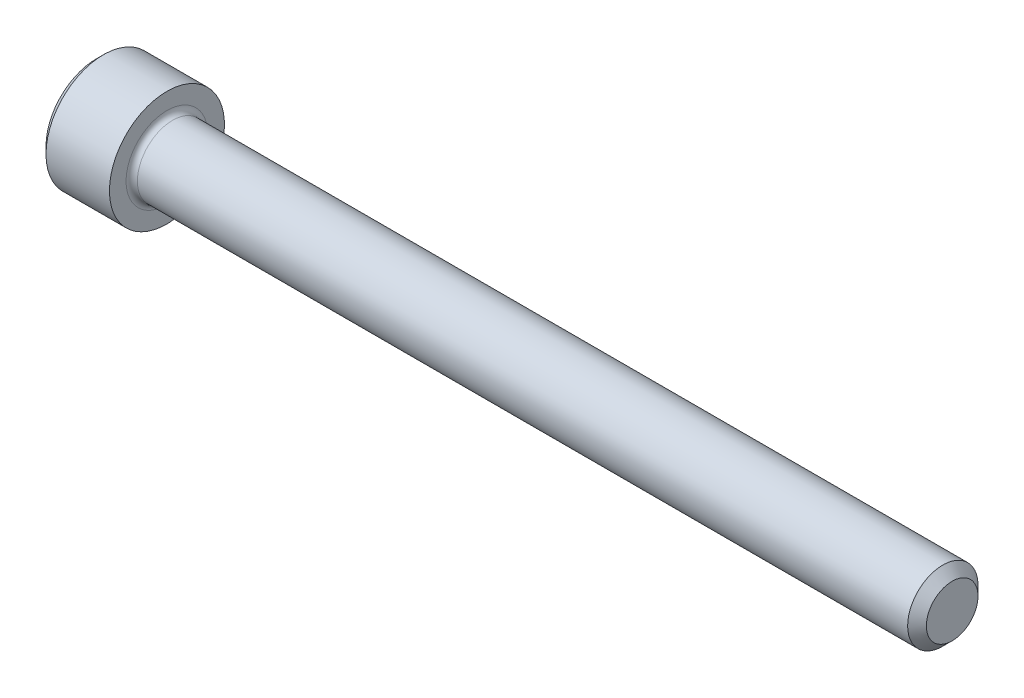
from build123d import *

# Parameters (mm, degrees)
FILLET1_R   = 0.2286
HEX_2_DEPTH = 1.2954


with BuildPart() as part:
    # BodySke → Base-Revolve (revolve)
    with BuildSketch(Plane.XY, mode=Mode.PRIVATE) as base_revolve_sk:
        Polygon((0, 0), (0, 2.0447), (0.2794, 2.3241), (2.8448, 2.3241), (2.8448, 1.4224), (34.21634, 1.4224), (34.5948, 1.04394), (34.5948, 0), align=None)
    revolve(base_revolve_sk.sketch.rotate(Axis((-31.75, 0, 0), (1, 0, 0)), 90), axis=Axis((-31.75, 0, 0), (1, 0, 0)))

    # Fillet1
    fillet1_edges = [part.edges().sort_by_distance(p)[0] for p in [
        (2.8448, 0, -1.4224),
    ]]
    fillet(fillet1_edges, radius=FILLET1_R)

    # Sketch2 → Hex-PreBroach (revolve, cut)
    with BuildSketch(Plane.XY, mode=Mode.PRIVATE) as hex_prebroach_sk:
        Polygon((0, 1.1938), (1.2954, 1.1938), (1.984640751, 0), (0, 0), align=None)
    revolve(hex_prebroach_sk.sketch.rotate(Axis((0, 0, 0), (1, 0, 0)), 90), axis=Axis((0, 0, 0), (1, 0, 0)), mode=Mode.SUBTRACT)

    # Sketch3 → Hex 2 (cut)
    with BuildSketch(Plane(origin=(0, 0, 0), x_dir=(0, 0.500000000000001, 0.866025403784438), z_dir=(-1, 0, 0))):
        Polygon((0.689240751, 1.1938), (-0.689240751, 1.1938), (-1.378481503, 0), (-0.689240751, -1.1938), (0.689240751, -1.1938), (1.378481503, 0), align=None)
    extrude(amount=-HEX_2_DEPTH, mode=Mode.SUBTRACT)


solid = part.part
